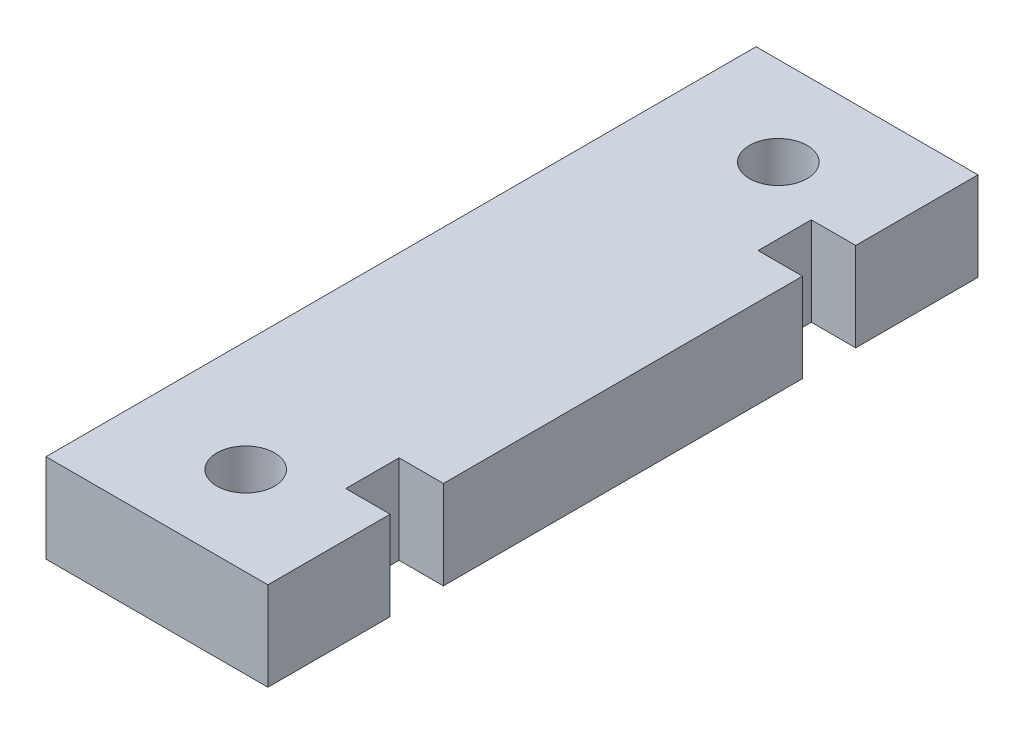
from build123d import *

# Parameters (mm, degrees)
ESQUISSE1_W             = 25
ESQUISSE1_H             = 10
EXTRUSION1_DEPTH        = 80
ESQUISSE2_R             = 3.25
ENL_V_MAT_EXTRU_1_DEPTH = 10
ESQUISSE9_W             = 6
ESQUISSE9_H             = 10
ENL_V_MAT_EXTRU_4_DEPTH = 5


with BuildPart() as part:
    # Esquisse1 → Extrusion1 (new body)
    with BuildSketch(Plane.XY):
        with Locations((12.5, 5)):
            Rectangle(ESQUISSE1_W, ESQUISSE1_H)
    extrude(amount=-EXTRUSION1_DEPTH)

    # Esquisse2 → Enl_v. mat.-Extru.1 (cut)
    with BuildSketch(Plane(origin=(0, 10, 0), x_dir=(-1, 0, 0), z_dir=(0, 1, 0))):
        with Locations(Location((-12.5, -70, 0), (0, 0, 90))):
            Circle(ESQUISSE2_R)
        with Locations(Location((-12.5, -10, 0), (0, 0, 270))):
            Circle(ESQUISSE2_R)
    extrude(amount=-ENL_V_MAT_EXTRU_1_DEPTH, mode=Mode.SUBTRACT)

    # Esquisse9 → Enl_v. mat.-Extru.4 (cut)
    with BuildSketch(Plane(origin=(25, 0, 0), x_dir=(0, 0, -1), z_dir=(1, 0, 0))):
        with Locations((16.776291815, 5)):
            Rectangle(ESQUISSE9_W, ESQUISSE9_H)
        with Locations((63.223708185, 5)):
            Rectangle(ESQUISSE9_W, ESQUISSE9_H)
    extrude(amount=-ENL_V_MAT_EXTRU_4_DEPTH, mode=Mode.SUBTRACT)


solid = part.part
